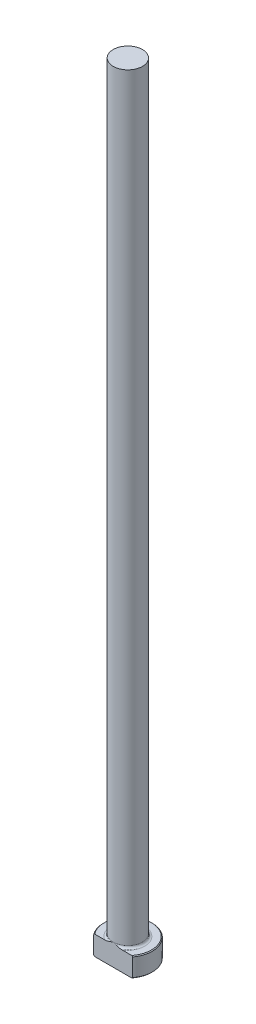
ISO-10303-21;
HEADER;
FILE_DESCRIPTION(('STEP AP214'),'2;1');
FILE_NAME('part.step','',(''),(''),'','','');
FILE_SCHEMA(('AUTOMOTIVE_DESIGN { 1 0 10303 214 1 1 1 1 }'));
ENDSEC;
DATA;
#1=APPLICATION_CONTEXT('core data for automotive mechanical design processes');
#2=APPLICATION_PROTOCOL_DEFINITION('international standard','automotive_design',2000,#1);
#3=PRODUCT_CONTEXT('',#1,'mechanical');
#4=PRODUCT('Part','Part','',(#3));
#5=PRODUCT_RELATED_PRODUCT_CATEGORY('part','',(#4));
#6=PRODUCT_DEFINITION_FORMATION('','',#4);
#7=PRODUCT_DEFINITION_CONTEXT('part definition',#1,'design');
#8=PRODUCT_DEFINITION('design','',#6,#7);
#9=PRODUCT_DEFINITION_SHAPE('','',#8);
#10=(LENGTH_UNIT() NAMED_UNIT(*) SI_UNIT(.MILLI.,.METRE.));
#11=(NAMED_UNIT(*) PLANE_ANGLE_UNIT() SI_UNIT($,.RADIAN.));
#12=(NAMED_UNIT(*) SI_UNIT($,.STERADIAN.) SOLID_ANGLE_UNIT());
#13=UNCERTAINTY_MEASURE_WITH_UNIT(LENGTH_MEASURE(1.E-05),#10,'distance_accuracy_value','');
#14=(GEOMETRIC_REPRESENTATION_CONTEXT(3) GLOBAL_UNCERTAINTY_ASSIGNED_CONTEXT((#13)) GLOBAL_UNIT_ASSIGNED_CONTEXT((#10,
#11,#12)) REPRESENTATION_CONTEXT('',''));
#15=CARTESIAN_POINT('',(0.,0.,0.));
#16=DIRECTION('',(0.,0.,1.));
#17=DIRECTION('',(1.,0.,0.));
#18=AXIS2_PLACEMENT_3D('',#15,#16,#17);
#19=CARTESIAN_POINT('',(0.,0.,0.));
#20=DIRECTION('',(0.,-1.,0.));
#21=DIRECTION('',(0.,0.,-1.));
#22=AXIS2_PLACEMENT_3D('',#19,#20,#21);
#23=PLANE('',#22);
#24=CARTESIAN_POINT('',(0.,0.,0.));
#25=DIRECTION('',(0.,-1.,0.));
#26=DIRECTION('',(0.,0.,-1.));
#27=AXIS2_PLACEMENT_3D('',#24,#25,#26);
#28=CIRCLE('',#27,7.68349999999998);
#29=CARTESIAN_POINT('',(-6.02949135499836,0.,4.76249999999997));
#30=VERTEX_POINT('',#29);
#31=CARTESIAN_POINT('',(6.02949135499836,0.,4.76249999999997));
#32=VERTEX_POINT('',#31);
#33=EDGE_CURVE('E98',#30,#32,#28,.T.);
#34=ORIENTED_EDGE('',*,*,#33,.T.);
#35=DIRECTION('',(-1.,0.,0.));
#36=VECTOR('',#35,1.);
#37=CARTESIAN_POINT('',(-6.34999999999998,0.,4.76249999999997));
#38=LINE('',#37,#36);
#39=EDGE_CURVE('E83',#32,#30,#38,.T.);
#40=ORIENTED_EDGE('',*,*,#39,.T.);
#41=EDGE_LOOP('',(#34,#40));
#42=FACE_BOUND('',#41,.T.);
#43=ADVANCED_FACE('F32',(#42),#23,.T.);
#44=CARTESIAN_POINT('',(0.,259.958771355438,0.));
#45=DIRECTION('',(0.,1.,0.));
#46=DIRECTION('',(0.,0.,1.));
#47=AXIS2_PLACEMENT_3D('',#44,#45,#46);
#48=CYLINDRICAL_SURFACE('',#47,7.93749999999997);
#49=CARTESIAN_POINT('',(0.,6.09599999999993,0.));
#50=DIRECTION('',(0.,1.,0.));
#51=DIRECTION('',(0.,0.,1.));
#52=AXIS2_PLACEMENT_3D('',#49,#50,#51);
#53=CIRCLE('',#52,7.93749999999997);
#54=CARTESIAN_POINT('',(-6.34999999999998,6.09599999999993,4.76249999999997));
#55=VERTEX_POINT('',#54);
#56=CARTESIAN_POINT('',(6.34999999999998,6.09599999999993,4.76249999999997));
#57=VERTEX_POINT('',#56);
#58=EDGE_CURVE('E104',#55,#57,#53,.F.);
#59=ORIENTED_EDGE('',*,*,#58,.T.);
#60=DIRECTION('',(0.,-1.,0.));
#61=VECTOR('',#60,1.);
#62=CARTESIAN_POINT('',(6.34999999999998,254.,4.76249999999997));
#63=LINE('',#62,#61);
#64=CARTESIAN_POINT('',(6.34999999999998,0.253999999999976,4.76249999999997));
#65=VERTEX_POINT('',#64);
#66=EDGE_CURVE('E183',#57,#65,#63,.T.);
#67=ORIENTED_EDGE('',*,*,#66,.T.);
#68=CARTESIAN_POINT('',(0.,0.253999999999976,0.));
#69=DIRECTION('',(0.,-1.,0.));
#70=DIRECTION('',(0.,0.,-1.));
#71=AXIS2_PLACEMENT_3D('',#68,#69,#70);
#72=CIRCLE('',#71,7.93749999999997);
#73=CARTESIAN_POINT('',(-6.34999999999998,0.253999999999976,4.76249999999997));
#74=VERTEX_POINT('',#73);
#75=EDGE_CURVE('E100',#65,#74,#72,.F.);
#76=ORIENTED_EDGE('',*,*,#75,.T.);
#77=DIRECTION('',(0.,-1.,0.));
#78=VECTOR('',#77,1.);
#79=CARTESIAN_POINT('',(-6.34999999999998,254.,4.76249999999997));
#80=LINE('',#79,#78);
#81=EDGE_CURVE('E93',#55,#74,#80,.T.);
#82=ORIENTED_EDGE('',*,*,#81,.F.);
#83=EDGE_LOOP('',(#59,#67,#76,#82));
#84=FACE_BOUND('',#83,.T.);
#85=ADVANCED_FACE('F158',(#84),#48,.T.);
#86=CARTESIAN_POINT('',(-7.93749999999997,6.35,0.));
#87=DIRECTION('',(0.,1.,0.));
#88=DIRECTION('',(0.,0.,1.));
#89=AXIS2_PLACEMENT_3D('',#86,#87,#88);
#90=PLANE('',#89);
#91=CARTESIAN_POINT('',(0.,6.35,0.));
#92=DIRECTION('',(0.,1.,0.));
#93=DIRECTION('',(0.,0.,1.));
#94=AXIS2_PLACEMENT_3D('',#91,#92,#93);
#95=CIRCLE('',#94,7.68349999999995);
#96=CARTESIAN_POINT('',(6.02949135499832,6.35,4.76249999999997));
#97=VERTEX_POINT('',#96);
#98=CARTESIAN_POINT('',(-6.02949135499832,6.35,4.76249999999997));
#99=VERTEX_POINT('',#98);
#100=EDGE_CURVE('E178',#97,#99,#95,.T.);
#101=ORIENTED_EDGE('',*,*,#100,.T.);
#102=DIRECTION('',(1.,0.,0.));
#103=VECTOR('',#102,1.);
#104=CARTESIAN_POINT('',(-7.93749999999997,6.35,4.76249999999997));
#105=LINE('',#104,#103);
#106=CARTESIAN_POINT('',(-2.79976677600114,6.35000000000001,4.76249999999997));
#107=VERTEX_POINT('',#106);
#108=EDGE_CURVE('E57',#99,#107,#105,.T.);
#109=ORIENTED_EDGE('',*,*,#108,.T.);
#110=CARTESIAN_POINT('',(0.,6.35,0.));
#111=DIRECTION('',(0.,1.,0.));
#112=DIRECTION('',(0.,0.,1.));
#113=AXIS2_PLACEMENT_3D('',#110,#111,#112);
#114=CIRCLE('',#113,5.52449999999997);
#115=CARTESIAN_POINT('',(2.79976677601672,6.35000000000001,4.76249999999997));
#116=VERTEX_POINT('',#115);
#117=EDGE_CURVE('E107',#107,#116,#114,.F.);
#118=ORIENTED_EDGE('',*,*,#117,.T.);
#119=EDGE_CURVE('E136',#116,#97,#105,.T.);
#120=ORIENTED_EDGE('',*,*,#119,.T.);
#121=EDGE_LOOP('',(#101,#109,#118,#120));
#122=FACE_BOUND('',#121,.T.);
#123=ADVANCED_FACE('F147',(#122),#90,.T.);
#124=CARTESIAN_POINT('',(0.,6.35000000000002,0.));
#125=DIRECTION('',(0.,-1.,0.));
#126=DIRECTION('',(0.,0.,-1.));
#127=AXIS2_PLACEMENT_3D('',#124,#125,#126);
#128=CONICAL_SURFACE('',#127,7.68349999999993,0.78539816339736);
#129=ORIENTED_EDGE('',*,*,#58,.F.);
#130=CARTESIAN_POINT('',(-13.9717238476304,-0.727613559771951,4.76249999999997));
#131=CARTESIAN_POINT('',(-13.7440124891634,-0.512084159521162,4.76249999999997));
#132=CARTESIAN_POINT('',(-13.5160318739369,-0.296838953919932,4.76249999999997));
#133=CARTESIAN_POINT('',(-13.0594385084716,0.132982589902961,4.76249999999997));
#134=CARTESIAN_POINT('',(-12.8308257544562,0.347558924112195,4.76249999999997));
#135=CARTESIAN_POINT('',(-12.1433698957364,0.990628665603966,4.76249999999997));
#136=CARTESIAN_POINT('',(-11.6834388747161,1.41796058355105,4.76249999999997));
#137=CARTESIAN_POINT('',(-10.7398192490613,2.28660831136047,4.76249999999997));
#138=CARTESIAN_POINT('',(-10.2559580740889,2.72773732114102,4.76249999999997));
#139=CARTESIAN_POINT('',(-9.52579613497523,3.38404130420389,4.76249999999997));
#140=CARTESIAN_POINT('',(-9.28181372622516,3.60179461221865,4.76249999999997));
#141=CARTESIAN_POINT('',(-8.79195583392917,4.03515959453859,4.76249999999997));
#142=CARTESIAN_POINT('',(-8.54608036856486,4.25077128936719,4.76249999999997));
#143=CARTESIAN_POINT('',(-8.05235063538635,4.67899963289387,4.76249999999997));
#144=CARTESIAN_POINT('',(-7.80449972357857,4.89162014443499,4.76249999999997));
#145=CARTESIAN_POINT('',(-7.30587283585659,5.31343752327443,4.76249999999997));
#146=CARTESIAN_POINT('',(-7.0550967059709,5.52263420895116,4.76249999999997));
#147=CARTESIAN_POINT('',(-6.54895570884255,5.93726289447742,4.76249999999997));
#148=CARTESIAN_POINT('',(-6.29357776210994,6.14267898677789,4.76249999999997));
#149=CARTESIAN_POINT('',(-5.77806261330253,6.54738613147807,4.76249999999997));
#150=CARTESIAN_POINT('',(-5.51792616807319,6.74667814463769,4.76249999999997));
#151=CARTESIAN_POINT('',(-4.99669315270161,7.13290361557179,4.76249999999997));
#152=CARTESIAN_POINT('',(-4.73572280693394,7.32000565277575,4.76249999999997));
#153=CARTESIAN_POINT('',(-4.33820944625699,7.59205599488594,4.76249999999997));
#154=CARTESIAN_POINT('',(-4.20463607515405,7.68134253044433,4.76249999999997));
#155=CARTESIAN_POINT('',(-3.93520014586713,7.85638938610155,4.76249999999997));
#156=CARTESIAN_POINT('',(-3.79933771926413,7.94214990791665,4.76249999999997));
#157=CARTESIAN_POINT('',(-3.5258207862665,8.10887856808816,4.76249999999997));
#158=CARTESIAN_POINT('',(-3.38818211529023,8.1898725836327,4.76249999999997));
#159=CARTESIAN_POINT('',(-3.10994368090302,8.3466779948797,4.76249999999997));
#160=CARTESIAN_POINT('',(-2.96934354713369,8.42248873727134,4.76249999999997));
#161=CARTESIAN_POINT('',(-2.68509318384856,8.56758570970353,4.76249999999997));
#162=CARTESIAN_POINT('',(-2.54144841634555,8.63688258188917,4.76249999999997));
#163=CARTESIAN_POINT('',(-2.25062082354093,8.7675871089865,4.76249999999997));
#164=CARTESIAN_POINT('',(-2.103439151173,8.82899729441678,4.76249999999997));
#165=CARTESIAN_POINT('',(-1.88433335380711,8.91218004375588,4.76249999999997));
#166=CARTESIAN_POINT('',(-1.81383186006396,8.93772120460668,4.76249999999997));
#167=CARTESIAN_POINT('',(-1.67202052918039,8.98645907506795,4.76249999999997));
#168=CARTESIAN_POINT('',(-1.60071065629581,9.00965568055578,4.76249999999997));
#169=CARTESIAN_POINT('',(-1.38555472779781,9.07542289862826,4.76249999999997));
#170=CARTESIAN_POINT('',(-1.24050522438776,9.11416209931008,4.76249999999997));
#171=CARTESIAN_POINT('',(-0.948515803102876,9.17953563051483,4.76249999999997));
#172=CARTESIAN_POINT('',(-0.801590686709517,9.20623542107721,4.76249999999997));
#173=CARTESIAN_POINT('',(-0.505930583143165,9.24644001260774,4.76249999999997));
#174=CARTESIAN_POINT('',(-0.357195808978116,9.25994635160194,4.76249999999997));
#175=CARTESIAN_POINT('',(-0.0580773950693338,9.27300540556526,4.76249999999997));
#176=CARTESIAN_POINT('',(0.0923105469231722,9.27246142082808,4.76249999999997));
#177=CARTESIAN_POINT('',(0.392354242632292,9.25721584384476,4.76249999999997));
#178=CARTESIAN_POINT('',(0.542009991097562,9.24251415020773,4.76249999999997));
#179=CARTESIAN_POINT('',(0.840076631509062,9.19973713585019,4.76249999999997));
#180=CARTESIAN_POINT('',(0.988478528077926,9.17160009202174,4.76249999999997));
#181=CARTESIAN_POINT('',(1.28250292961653,9.10341431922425,4.76249999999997));
#182=CARTESIAN_POINT('',(1.42812484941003,9.06336311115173,4.76249999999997));
#183=CARTESIAN_POINT('',(1.80157652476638,8.94630142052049,4.76249999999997));
#184=CARTESIAN_POINT('',(2.02694427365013,8.86145845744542,4.76249999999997));
#185=CARTESIAN_POINT('',(2.46947102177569,8.67257542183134,4.76249999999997));
#186=CARTESIAN_POINT('',(2.68662307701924,8.56851952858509,4.76249999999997));
#187=CARTESIAN_POINT('',(3.00782565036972,8.40144847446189,4.76249999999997));
#188=CARTESIAN_POINT('',(3.1146332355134,8.34362692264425,4.76249999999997));
#189=CARTESIAN_POINT('',(3.32653927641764,8.22492412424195,4.76249999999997));
#190=CARTESIAN_POINT('',(3.43163771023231,8.16404283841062,4.76249999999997));
#191=CARTESIAN_POINT('',(3.64022442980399,8.0397004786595,4.76249999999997));
#192=CARTESIAN_POINT('',(3.74371344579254,7.9762406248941,4.76249999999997));
#193=CARTESIAN_POINT('',(3.94927417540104,7.84708004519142,4.76249999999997));
#194=CARTESIAN_POINT('',(4.05134594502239,7.78137940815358,4.76249999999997));
#195=CARTESIAN_POINT('',(4.39010681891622,7.55875403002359,4.76249999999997));
#196=CARTESIAN_POINT('',(4.62396840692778,7.39752115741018,4.76249999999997));
#197=CARTESIAN_POINT('',(5.08629215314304,7.06746483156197,4.76249999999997));
#198=CARTESIAN_POINT('',(5.31475310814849,6.89863971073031,4.76249999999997));
#199=CARTESIAN_POINT('',(5.76756292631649,6.55523763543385,4.76249999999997));
#200=CARTESIAN_POINT('',(5.99190862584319,6.38065652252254,4.76249999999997));
#201=CARTESIAN_POINT('',(6.4371751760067,6.02723273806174,4.76249999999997));
#202=CARTESIAN_POINT('',(6.65809630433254,5.84839041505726,4.76249999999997));
#203=CARTESIAN_POINT('',(7.09790647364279,5.48680641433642,4.76249999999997));
#204=CARTESIAN_POINT('',(7.31678672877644,5.30405407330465,4.76249999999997));
#205=CARTESIAN_POINT('',(7.75231370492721,4.93590430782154,4.76249999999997));
#206=CARTESIAN_POINT('',(7.96896038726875,4.75050683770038,4.76249999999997));
#207=CARTESIAN_POINT('',(8.40032527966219,4.3776669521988,4.76249999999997));
#208=CARTESIAN_POINT('',(8.61504426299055,4.19022543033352,4.76249999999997));
#209=CARTESIAN_POINT('',(9.04295707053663,3.81360841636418,4.76249999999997));
#210=CARTESIAN_POINT('',(9.25615088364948,3.62443291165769,4.76249999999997));
#211=CARTESIAN_POINT('',(9.85099823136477,3.09302727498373,4.76249999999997));
#212=CARTESIAN_POINT('',(10.231229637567,2.74920552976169,4.76249999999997));
#213=CARTESIAN_POINT('',(10.9886755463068,2.0581727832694,4.76249999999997));
#214=CARTESIAN_POINT('',(11.3658896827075,1.71096138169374,4.76249999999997));
#215=CARTESIAN_POINT('',(12.1155837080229,1.01624347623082,4.76249999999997));
#216=CARTESIAN_POINT('',(12.4880784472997,0.668752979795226,4.76249999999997));
#217=CARTESIAN_POINT('',(13.2311819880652,-0.0281268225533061,4.76249999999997));
#218=CARTESIAN_POINT('',(13.601791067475,-0.377515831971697,4.76249999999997));
#219=CARTESIAN_POINT('',(13.9717238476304,-0.727613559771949,4.76249999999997));
#220=B_SPLINE_CURVE_WITH_KNOTS('',3,(#130,#131,#132,#133,#134,#135,#136,#137,#138,#139,#140,
#141,#142,#143,#144,#145,#146,#147,#148,#149,#150,#151,#152,#153,#154,#155,#156,#157,#158,#159,
#160,#161,#162,#163,#164,#165,#166,#167,#168,#169,#170,#171,#172,#173,#174,#175,#176,#177,#178,
#179,#180,#181,#182,#183,#184,#185,#186,#187,#188,#189,#190,#191,#192,#193,#194,#195,#196,#197,
#198,#199,#200,#201,#202,#203,#204,#205,#206,#207,#208,#209,#210,#211,#212,#213,#214,#215,#216,
#217,#218,#219),.UNSPECIFIED.,.F.,.F.,(4,2,2,2,2,2,2,2,2,2,2,2,2,2,2,2,2,2,2,2,2,2,2,2,2,2,2,2,
2,2,2,2,2,2,2,2,2,2,2,2,2,2,2,2,4),(0.,0.940610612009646,1.88122685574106,3.76464908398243,
5.7288903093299,6.70994924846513,7.69099877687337,8.67063680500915,9.65032663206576,
10.6334769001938,11.6164721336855,12.5795523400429,13.0615108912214,13.5434418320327,
14.0224542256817,14.5015268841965,14.979802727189,15.4579247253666,15.6828447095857,
15.9077746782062,16.357707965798,16.8051644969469,17.2525688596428,17.7030532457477,
18.1535408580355,18.6061182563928,19.0587898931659,19.779913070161,20.5016327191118,
20.8659558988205,21.2302837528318,21.5944411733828,21.9585841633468,22.8105074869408,
23.6626188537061,24.5153599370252,25.3680315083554,26.2234368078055,27.0788568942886,
27.9339169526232,28.7889832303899,30.3268416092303,31.8648838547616,33.3931161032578,
34.9211161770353),.UNSPECIFIED.);
#221=EDGE_CURVE('E135',#55,#99,#220,.T.);
#222=ORIENTED_EDGE('',*,*,#221,.T.);
#223=ORIENTED_EDGE('',*,*,#100,.F.);
#224=EDGE_CURVE('E127',#97,#57,#220,.T.);
#225=ORIENTED_EDGE('',*,*,#224,.T.);
#226=EDGE_LOOP('',(#129,#222,#223,#225));
#227=FACE_BOUND('',#226,.T.);
#228=ADVANCED_FACE('F143',(#227),#128,.T.);
#229=CARTESIAN_POINT('',(0.,0.253999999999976,0.));
#230=DIRECTION('',(0.,1.,0.));
#231=DIRECTION('',(0.,0.,1.));
#232=AXIS2_PLACEMENT_3D('',#229,#230,#231);
#233=CONICAL_SURFACE('',#232,7.93749999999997,0.785398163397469);
#234=ORIENTED_EDGE('',*,*,#75,.F.);
#235=CARTESIAN_POINT('',(13.9717238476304,7.07761355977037,4.76249999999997));
#236=CARTESIAN_POINT('',(13.7440124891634,6.86208415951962,4.76249999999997));
#237=CARTESIAN_POINT('',(13.5160318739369,6.64683895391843,4.76249999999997));
#238=CARTESIAN_POINT('',(13.0594385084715,6.21701741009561,4.76249999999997));
#239=CARTESIAN_POINT('',(12.8308257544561,6.00244107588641,4.76249999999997));
#240=CARTESIAN_POINT('',(12.1433698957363,5.35937133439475,4.76249999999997));
#241=CARTESIAN_POINT('',(11.683438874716,4.93203941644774,4.76249999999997));
#242=CARTESIAN_POINT('',(10.7398192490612,4.06339168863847,4.76249999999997));
#243=CARTESIAN_POINT('',(10.2559580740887,3.62226267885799,4.76249999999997));
#244=CARTESIAN_POINT('',(9.525796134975,2.96595869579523,4.76249999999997));
#245=CARTESIAN_POINT('',(9.28181372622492,2.74820538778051,4.76249999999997));
#246=CARTESIAN_POINT('',(8.79195583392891,2.31484040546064,4.76249999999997));
#247=CARTESIAN_POINT('',(8.54608036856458,2.09922871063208,4.76249999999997));
#248=CARTESIAN_POINT('',(8.05235063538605,1.67100036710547,4.76249999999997));
#249=CARTESIAN_POINT('',(7.80449972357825,1.45837985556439,4.76249999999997));
#250=CARTESIAN_POINT('',(7.30587283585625,1.03656247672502,4.76249999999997));
#251=CARTESIAN_POINT('',(7.05509670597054,0.827365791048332,4.76249999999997));
#252=CARTESIAN_POINT('',(6.54895570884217,0.412737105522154,4.76249999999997));
#253=CARTESIAN_POINT('',(6.29357776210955,0.207321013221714,4.76249999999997));
#254=CARTESIAN_POINT('',(5.77806261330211,-0.197386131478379,4.76249999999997));
#255=CARTESIAN_POINT('',(5.51792616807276,-0.396678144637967,4.76249999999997));
#256=CARTESIAN_POINT('',(4.99669315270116,-0.782903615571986,4.76249999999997));
#257=CARTESIAN_POINT('',(4.73572280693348,-0.970005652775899,4.76249999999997));
#258=CARTESIAN_POINT('',(4.33820944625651,-1.24205599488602,4.76249999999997));
#259=CARTESIAN_POINT('',(4.20463607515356,-1.33134253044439,4.76249999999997));
#260=CARTESIAN_POINT('',(3.93520014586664,-1.50638938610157,4.76249999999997));
#261=CARTESIAN_POINT('',(3.79933771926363,-1.59214990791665,4.76249999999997));
#262=CARTESIAN_POINT('',(3.525820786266,-1.75887856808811,4.76249999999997));
#263=CARTESIAN_POINT('',(3.38818211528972,-1.83987258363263,4.76249999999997));
#264=CARTESIAN_POINT('',(3.1099436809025,-1.99667799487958,4.76249999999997));
#265=CARTESIAN_POINT('',(2.96934354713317,-2.07248873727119,4.76249999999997));
#266=CARTESIAN_POINT('',(2.68509318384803,-2.21758570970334,4.76249999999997));
#267=CARTESIAN_POINT('',(2.54144841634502,-2.28688258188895,4.76249999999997));
#268=CARTESIAN_POINT('',(2.25062082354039,-2.41758710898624,4.76249999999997));
#269=CARTESIAN_POINT('',(2.10343915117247,-2.47899729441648,4.76249999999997));
#270=CARTESIAN_POINT('',(1.88433335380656,-2.56218004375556,4.76249999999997));
#271=CARTESIAN_POINT('',(1.81383186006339,-2.58772120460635,4.76249999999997));
#272=CARTESIAN_POINT('',(1.6720205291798,-2.63645907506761,4.76249999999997));
#273=CARTESIAN_POINT('',(1.60071065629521,-2.65965568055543,4.76249999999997));
#274=CARTESIAN_POINT('',(1.38555472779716,-2.72542289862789,4.76249999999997));
#275=CARTESIAN_POINT('',(1.24050522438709,-2.76416209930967,4.76249999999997));
#276=CARTESIAN_POINT('',(0.94851580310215,-2.82953563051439,4.76249999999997));
#277=CARTESIAN_POINT('',(0.801590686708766,-2.85623542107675,4.76249999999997));
#278=CARTESIAN_POINT('',(0.505930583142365,-2.89644001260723,4.76249999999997));
#279=CARTESIAN_POINT('',(0.357195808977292,-2.9099463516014,4.76249999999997));
#280=CARTESIAN_POINT('',(0.0580773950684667,-2.92300540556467,4.76249999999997));
#281=CARTESIAN_POINT('',(-0.0923105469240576,-2.92246142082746,4.76249999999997));
#282=CARTESIAN_POINT('',(-0.392354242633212,-2.90721584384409,4.76249999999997));
#283=CARTESIAN_POINT('',(-0.5420099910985,-2.89251415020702,4.76249999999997));
#284=CARTESIAN_POINT('',(-0.840076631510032,-2.84973713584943,4.76249999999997));
#285=CARTESIAN_POINT('',(-0.988478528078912,-2.82160009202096,4.76249999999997));
#286=CARTESIAN_POINT('',(-1.28250292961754,-2.75341431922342,4.76249999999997));
#287=CARTESIAN_POINT('',(-1.42812484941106,-2.71336311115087,4.76249999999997));
#288=CARTESIAN_POINT('',(-1.80157652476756,-2.59630142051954,4.76249999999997));
#289=CARTESIAN_POINT('',(-2.02694427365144,-2.5114584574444,4.76249999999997));
#290=CARTESIAN_POINT('',(-2.46947102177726,-2.32257542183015,4.76249999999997));
#291=CARTESIAN_POINT('',(-2.68662307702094,-2.21851952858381,4.76249999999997));
#292=CARTESIAN_POINT('',(-3.0078256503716,-2.05144847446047,4.76249999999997));
#293=CARTESIAN_POINT('',(-3.11463323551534,-1.99362692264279,4.76249999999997));
#294=CARTESIAN_POINT('',(-3.3265392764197,-1.87492412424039,4.76249999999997));
#295=CARTESIAN_POINT('',(-3.43163771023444,-1.81404283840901,4.76249999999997));
#296=CARTESIAN_POINT('',(-3.64022442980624,-1.68970047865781,4.76249999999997));
#297=CARTESIAN_POINT('',(-3.74371344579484,-1.62624062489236,4.76249999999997));
#298=CARTESIAN_POINT('',(-3.94927417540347,-1.49708004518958,4.76249999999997));
#299=CARTESIAN_POINT('',(-4.05134594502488,-1.43137940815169,4.76249999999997));
#300=CARTESIAN_POINT('',(-4.39010681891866,-1.2087540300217,4.76249999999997));
#301=CARTESIAN_POINT('',(-4.62396840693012,-1.04752115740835,4.76249999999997));
#302=CARTESIAN_POINT('',(-5.08629215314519,-0.71746483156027,4.76249999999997));
#303=CARTESIAN_POINT('',(-5.31475310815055,-0.548639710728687,4.76249999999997));
#304=CARTESIAN_POINT('',(-5.76756292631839,-0.205237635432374,4.76249999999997));
#305=CARTESIAN_POINT('',(-5.991908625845,-0.03065652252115,4.76249999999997));
#306=CARTESIAN_POINT('',(-6.43717517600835,0.322767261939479,4.76249999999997));
#307=CARTESIAN_POINT('',(-6.65809630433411,0.50160958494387,4.76249999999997));
#308=CARTESIAN_POINT('',(-7.0979064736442,0.863193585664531,4.76249999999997));
#309=CARTESIAN_POINT('',(-7.31678672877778,1.04594592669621,4.76249999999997));
#310=CARTESIAN_POINT('',(-7.7523137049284,1.41409569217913,4.76249999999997));
#311=CARTESIAN_POINT('',(-7.96896038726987,1.5994931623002,4.76249999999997));
#312=CARTESIAN_POINT('',(-8.40032527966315,1.97233304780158,4.76249999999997));
#313=CARTESIAN_POINT('',(-8.61504426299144,2.15977456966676,4.76249999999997));
#314=CARTESIAN_POINT('',(-9.04295707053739,2.5363915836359,4.76249999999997));
#315=CARTESIAN_POINT('',(-9.25615088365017,2.72556708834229,4.76249999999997));
#316=CARTESIAN_POINT('',(-9.85099823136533,3.25697272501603,4.76249999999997));
#317=CARTESIAN_POINT('',(-10.2312296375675,3.60079447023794,4.76249999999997));
#318=CARTESIAN_POINT('',(-10.9886755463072,4.29182721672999,4.76249999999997));
#319=CARTESIAN_POINT('',(-11.3658896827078,4.63903861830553,4.76249999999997));
#320=CARTESIAN_POINT('',(-12.1155837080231,5.3337565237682,4.76249999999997));
#321=CARTESIAN_POINT('',(-12.4880784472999,5.68124702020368,4.76249999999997));
#322=CARTESIAN_POINT('',(-13.2311819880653,6.37812682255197,4.76249999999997));
#323=CARTESIAN_POINT('',(-13.6017910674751,6.72751583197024,4.76249999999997));
#324=CARTESIAN_POINT('',(-13.9717238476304,7.07761355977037,4.76249999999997));
#325=B_SPLINE_CURVE_WITH_KNOTS('',3,(#235,#236,#237,#238,#239,#240,#241,#242,#243,#244,#245,
#246,#247,#248,#249,#250,#251,#252,#253,#254,#255,#256,#257,#258,#259,#260,#261,#262,#263,#264,
#265,#266,#267,#268,#269,#270,#271,#272,#273,#274,#275,#276,#277,#278,#279,#280,#281,#282,#283,
#284,#285,#286,#287,#288,#289,#290,#291,#292,#293,#294,#295,#296,#297,#298,#299,#300,#301,#302,
#303,#304,#305,#306,#307,#308,#309,#310,#311,#312,#313,#314,#315,#316,#317,#318,#319,#320,#321,
#322,#323,#324),.UNSPECIFIED.,.F.,.F.,(4,2,2,2,2,2,2,2,2,2,2,2,2,2,2,2,2,2,2,2,2,2,2,2,2,2,2,2,
2,2,2,2,2,2,2,2,2,2,2,2,2,2,2,2,4),(0.,0.940610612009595,1.88122685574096,3.76464908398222,
5.7288903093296,6.70994924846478,7.69099877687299,8.67063680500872,9.65032663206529,
10.6334769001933,11.6164721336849,12.5795523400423,13.0615108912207,13.543441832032,
14.022454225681,14.5015268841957,14.9798027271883,15.4579247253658,15.682844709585,
15.9077746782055,16.3577079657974,16.8051644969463,17.2525688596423,17.7030532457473,
18.1535408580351,18.6061182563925,19.0587898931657,19.7799130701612,20.5016327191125,
20.8659558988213,21.2302837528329,21.5944411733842,21.9585841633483,22.8105074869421,
23.6626188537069,24.5153599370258,25.3680315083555,26.2234368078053,27.0788568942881,
27.9339169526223,28.7889832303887,30.3268416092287,31.8648838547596,33.3931161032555,
34.9211161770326),.UNSPECIFIED.);
#326=EDGE_CURVE('E86',#65,#32,#325,.T.);
#327=ORIENTED_EDGE('',*,*,#326,.T.);
#328=ORIENTED_EDGE('',*,*,#33,.F.);
#329=EDGE_CURVE('E89',#30,#74,#325,.T.);
#330=ORIENTED_EDGE('',*,*,#329,.T.);
#331=EDGE_LOOP('',(#234,#327,#328,#330));
#332=FACE_BOUND('',#331,.T.);
#333=ADVANCED_FACE('F97',(#332),#233,.T.);
#334=CARTESIAN_POINT('',(0.,7.11200000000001,0.));
#335=DIRECTION('',(0.,1.,0.));
#336=DIRECTION('',(0.,0.,1.));
#337=AXIS2_PLACEMENT_3D('',#334,#335,#336);
#338=TOROIDAL_SURFACE('',#337,5.52449999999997,0.762);
#339=CARTESIAN_POINT('',(0.,7.11200000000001,4.76249999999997));
#340=CARTESIAN_POINT('',(1.7571576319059E-10,7.11200099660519,4.76249999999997));
#341=CARTESIAN_POINT('',(2.11716127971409E-07,7.11200199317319,4.76249999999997));
#342=CARTESIAN_POINT('',(8.80753956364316E-07,7.1120039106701,4.76249999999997));
#343=CARTESIAN_POINT('',(1.34491796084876E-06,7.11200482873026,4.76249999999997));
#344=CARTESIAN_POINT('',(2.45982947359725E-06,7.11200666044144,4.76249999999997));
#345=CARTESIAN_POINT('',(3.12384157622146E-06,7.11200756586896,4.76249999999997));
#346=CARTESIAN_POINT('',(4.5550794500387E-06,7.11200927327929,4.76249999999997));
#347=CARTESIAN_POINT('',(5.32136303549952E-06,7.11201007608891,4.76249999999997));
#348=CARTESIAN_POINT('',(8.07192927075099E-06,7.11201277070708,4.76249999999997));
#349=CARTESIAN_POINT('',(1.01901643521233E-05,7.11201452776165,4.76249999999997));
#350=CARTESIAN_POINT('',(1.4565159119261E-05,7.11201765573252,4.76249999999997));
#351=CARTESIAN_POINT('',(1.68139275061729E-05,7.11201903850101,4.76249999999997));
#352=CARTESIAN_POINT('',(2.56002968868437E-05,7.1120242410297,4.76249999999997));
#353=CARTESIAN_POINT('',(3.23057719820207E-05,7.11202779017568,4.76249999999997));
#354=CARTESIAN_POINT('',(4.55210144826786E-05,7.11203358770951,4.76249999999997));
#355=CARTESIAN_POINT('',(5.19929180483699E-05,7.1120359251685,4.76249999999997));
#356=CARTESIAN_POINT('',(7.95921607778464E-05,7.11204586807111,4.76249999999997));
#357=CARTESIAN_POINT('',(0.000100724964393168,7.11205341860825,4.76249999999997));
#358=CARTESIAN_POINT('',(0.00014026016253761,7.11206552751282,4.76249999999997));
#359=CARTESIAN_POINT('',(0.000158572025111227,7.11207036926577,4.76249999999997));
#360=CARTESIAN_POINT('',(0.000291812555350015,7.11210874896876,4.76249999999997));
#361=CARTESIAN_POINT('',(0.000401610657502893,7.11215771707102,4.76249999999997));
#362=CARTESIAN_POINT('',(0.0008287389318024,7.1123412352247,4.76249999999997));
#363=CARTESIAN_POINT('',(0.00114963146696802,7.11246431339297,4.76249999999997));
#364=CARTESIAN_POINT('',(0.00239628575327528,7.11294956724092,4.76249999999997));
#365=CARTESIAN_POINT('',(0.00331839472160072,7.11332376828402,4.76249999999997));
#366=CARTESIAN_POINT('',(0.00709602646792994,7.11484953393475,4.76249999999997));
#367=CARTESIAN_POINT('',(0.00995556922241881,7.11598757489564,4.76249999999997));
#368=CARTESIAN_POINT('',(0.0776380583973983,7.14293320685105,4.76249999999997));
#369=CARTESIAN_POINT('',(0.142407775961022,7.16892226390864,4.76249999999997));
#370=CARTESIAN_POINT('',(0.269647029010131,7.2196189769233,4.76249999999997));
#371=CARTESIAN_POINT('',(0.332112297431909,7.24433828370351,4.76249999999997));
#372=CARTESIAN_POINT('',(0.464537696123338,7.29630170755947,4.76249999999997));
#373=CARTESIAN_POINT('',(0.534515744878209,7.32350106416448,4.76249999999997));
#374=CARTESIAN_POINT('',(0.67548014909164,7.3774238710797,4.76249999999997));
#375=CARTESIAN_POINT('',(0.746469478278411,7.40413956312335,4.76249999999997));
#376=CARTESIAN_POINT('',(0.870073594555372,7.44962494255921,4.76249999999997));
#377=CARTESIAN_POINT('',(0.922600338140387,7.46863321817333,4.76249999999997));
#378=CARTESIAN_POINT('',(1.02776923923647,7.50591527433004,4.76249999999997));
#379=CARTESIAN_POINT('',(1.08041080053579,7.52419073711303,4.76249999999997));
#380=CARTESIAN_POINT('',(1.23635883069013,7.5769919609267,4.76249999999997));
#381=CARTESIAN_POINT('',(1.34005657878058,7.61037532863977,4.76249999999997));
#382=CARTESIAN_POINT('',(1.56359060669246,7.67746997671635,4.76249999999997));
#383=CARTESIAN_POINT('',(1.68362015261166,7.71054957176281,4.76249999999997));
#384=CARTESIAN_POINT('',(1.92642555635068,7.76967498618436,4.76249999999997));
#385=CARTESIAN_POINT('',(2.04921557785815,7.79566353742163,4.76249999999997));
#386=CARTESIAN_POINT('',(2.30422797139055,7.83918726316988,4.76249999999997));
#387=CARTESIAN_POINT('',(2.43656426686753,7.85610069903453,4.76249999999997));
#388=CARTESIAN_POINT('',(2.63563546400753,7.8702758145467,4.76249999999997));
#389=CARTESIAN_POINT('',(2.70197039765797,7.87313972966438,4.76249999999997));
#390=CARTESIAN_POINT('',(2.83467605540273,7.87452977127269,4.76249999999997));
#391=CARTESIAN_POINT('',(2.90104677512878,7.87305634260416,4.76249999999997));
#392=CARTESIAN_POINT('',(3.06624711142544,7.86305254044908,4.76249999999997));
#393=CARTESIAN_POINT('',(3.1649502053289,7.85140164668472,4.76249999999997));
#394=CARTESIAN_POINT('',(3.3102514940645,7.82310986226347,4.76249999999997));
#395=CARTESIAN_POINT('',(3.35793795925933,7.81197880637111,4.76249999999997));
#396=CARTESIAN_POINT('',(3.45215770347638,7.78564548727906,4.76249999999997));
#397=CARTESIAN_POINT('',(3.49869187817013,7.77044650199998,4.76249999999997));
#398=CARTESIAN_POINT('',(3.59306902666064,7.73421407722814,4.76249999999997));
#399=CARTESIAN_POINT('',(3.64079022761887,7.71285751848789,4.76249999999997));
#400=CARTESIAN_POINT('',(3.73313951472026,7.66398014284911,4.76249999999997));
#401=CARTESIAN_POINT('',(3.77776331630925,7.63645100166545,4.76249999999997));
#402=CARTESIAN_POINT('',(3.8538778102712,7.58041326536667,4.76249999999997));
#403=CARTESIAN_POINT('',(3.88624519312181,7.55310714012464,4.76249999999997));
#404=CARTESIAN_POINT('',(3.94622799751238,7.49369496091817,4.76249999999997));
#405=CARTESIAN_POINT('',(3.97385320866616,7.46159905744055,4.76249999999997));
#406=CARTESIAN_POINT('',(4.01655184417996,7.4011650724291,4.76249999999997));
#407=CARTESIAN_POINT('',(4.03304226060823,7.37383278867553,4.76249999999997));
#408=CARTESIAN_POINT('',(4.06135260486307,7.31682811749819,4.76249999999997));
#409=CARTESIAN_POINT('',(4.07317539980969,7.28715718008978,4.76249999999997));
#410=CARTESIAN_POINT('',(4.09136459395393,7.22592510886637,4.76249999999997));
#411=CARTESIAN_POINT('',(4.09769076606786,7.19435181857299,4.76249999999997));
#412=CARTESIAN_POINT('',(4.10417375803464,7.13057793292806,4.76249999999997));
#413=CARTESIAN_POINT('',(4.10433369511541,7.0983776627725,4.76249999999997));
#414=CARTESIAN_POINT('',(4.09881588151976,7.03816798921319,4.76249999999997));
#415=CARTESIAN_POINT('',(4.09379438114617,7.01009545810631,4.76249999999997));
#416=CARTESIAN_POINT('',(4.07925766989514,6.95514890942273,4.76249999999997));
#417=CARTESIAN_POINT('',(4.06974176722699,6.92827507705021,4.76249999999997));
#418=CARTESIAN_POINT('',(4.04639465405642,6.87537805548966,4.76249999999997));
#419=CARTESIAN_POINT('',(4.03242569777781,6.84941634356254,4.76249999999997));
#420=CARTESIAN_POINT('',(4.00102190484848,6.79970293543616,4.76249999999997));
#421=CARTESIAN_POINT('',(3.98358563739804,6.77595215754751,4.76249999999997));
#422=CARTESIAN_POINT('',(3.93494606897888,6.71761387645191,4.76249999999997));
#423=CARTESIAN_POINT('',(3.90164076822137,6.68477550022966,4.76249999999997));
#424=CARTESIAN_POINT('',(3.83023707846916,6.62476083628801,4.76249999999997));
#425=CARTESIAN_POINT('',(3.79212391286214,6.59760272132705,4.76249999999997));
#426=CARTESIAN_POINT('',(3.69123876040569,6.53519525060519,4.76249999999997));
#427=CARTESIAN_POINT('',(3.62627547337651,6.5035096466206,4.76249999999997));
#428=CARTESIAN_POINT('',(3.49255240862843,6.45041788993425,4.76249999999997));
#429=CARTESIAN_POINT('',(3.42379589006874,6.42900306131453,4.76249999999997));
#430=CARTESIAN_POINT('',(3.29415895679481,6.39697273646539,4.76249999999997));
#431=CARTESIAN_POINT('',(3.23354049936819,6.38525800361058,4.76249999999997));
#432=CARTESIAN_POINT('',(3.11149484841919,6.36705546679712,4.76249999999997));
#433=CARTESIAN_POINT('',(3.05006701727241,6.36057206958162,4.76249999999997));
#434=CARTESIAN_POINT('',(2.92589148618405,6.35201311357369,4.76249999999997));
#435=CARTESIAN_POINT('',(2.86313887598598,6.35001297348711,4.76249999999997));
#436=CARTESIAN_POINT('',(2.73768820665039,6.34998716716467,4.76249999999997));
#437=CARTESIAN_POINT('',(2.67499013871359,6.35195889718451,4.76249999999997));
#438=CARTESIAN_POINT('',(2.52932457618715,6.3605299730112,4.76249999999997));
#439=CARTESIAN_POINT('',(2.44643477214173,6.36843196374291,4.76249999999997));
#440=CARTESIAN_POINT('',(2.28127175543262,6.38922870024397,4.76249999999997));
#441=CARTESIAN_POINT('',(2.19899884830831,6.40212577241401,4.76249999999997));
#442=CARTESIAN_POINT('',(1.95269348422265,6.44712458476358,4.76249999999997));
#443=CARTESIAN_POINT('',(1.78980549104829,6.48548332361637,4.76249999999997));
#444=CARTESIAN_POINT('',(1.48033682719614,6.56994207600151,4.76249999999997));
#445=CARTESIAN_POINT('',(1.33350347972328,6.615164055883,4.76249999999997));
#446=CARTESIAN_POINT('',(1.04345459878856,6.71161170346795,4.76249999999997));
#447=CARTESIAN_POINT('',(0.900217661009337,6.76277370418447,4.76249999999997));
#448=CARTESIAN_POINT('',(0.704750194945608,6.83559047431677,4.76249999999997));
#449=CARTESIAN_POINT('',(0.651886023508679,6.85558735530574,4.76249999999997));
#450=CARTESIAN_POINT('',(0.544940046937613,6.89652727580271,4.76249999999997));
#451=CARTESIAN_POINT('',(0.49086245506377,6.91748138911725,4.76249999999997));
#452=CARTESIAN_POINT('',(0.399545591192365,6.95317215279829,4.76249999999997));
#453=CARTESIAN_POINT('',(0.362273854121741,6.96782635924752,4.76249999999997));
#454=CARTESIAN_POINT('',(0.288146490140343,6.9971046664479,4.76249999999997));
#455=CARTESIAN_POINT('',(0.251290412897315,7.01172761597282,4.76249999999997));
#456=CARTESIAN_POINT('',(0.181451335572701,7.03949988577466,4.76249999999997));
#457=CARTESIAN_POINT('',(0.14846593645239,7.05264357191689,4.76249999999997));
#458=CARTESIAN_POINT('',(0.0812672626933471,7.07951218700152,4.76249999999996));
#459=CARTESIAN_POINT('',(0.0470550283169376,7.09324020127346,4.76249999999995));
#460=CARTESIAN_POINT('',(0.00995870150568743,7.10801136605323,4.76249999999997));
#461=CARTESIAN_POINT('',(0.00710220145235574,7.10914804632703,4.76249999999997));
#462=CARTESIAN_POINT('',(0.00332530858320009,7.11067346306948,4.76249999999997));
#463=CARTESIAN_POINT('',(0.00240087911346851,7.11104861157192,4.76249999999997));
#464=CARTESIAN_POINT('',(0.0011512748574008,7.11153501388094,4.76249999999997));
#465=CARTESIAN_POINT('',(0.000829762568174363,7.11165833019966,4.76249999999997));
#466=CARTESIAN_POINT('',(0.000401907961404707,7.1118421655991,4.76249999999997));
#467=CARTESIAN_POINT('',(0.000291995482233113,7.11189118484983,4.76249999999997));
#468=CARTESIAN_POINT('',(0.000158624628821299,7.11192959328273,4.76249999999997));
#469=CARTESIAN_POINT('',(0.000140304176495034,7.11193443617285,4.76249999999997));
#470=CARTESIAN_POINT('',(0.000100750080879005,7.11194655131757,4.76249999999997));
#471=CARTESIAN_POINT('',(7.96072020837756E-05,7.11195410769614,4.76249999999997));
#472=CARTESIAN_POINT('',(5.19966524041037E-05,7.11196405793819,4.76249999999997));
#473=CARTESIAN_POINT('',(4.55234098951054E-05,7.11196639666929,4.76249999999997));
#474=CARTESIAN_POINT('',(3.23056445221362E-05,7.11197219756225,4.76249999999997));
#475=CARTESIAN_POINT('',(2.559903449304E-05,7.11197574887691,4.76249999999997));
#476=CARTESIAN_POINT('',(1.68115971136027E-05,7.11198095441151,4.76249999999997));
#477=CARTESIAN_POINT('',(1.45627239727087E-05,7.11198233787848,4.76249999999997));
#478=CARTESIAN_POINT('',(1.01876581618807E-05,7.11198546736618,4.76249999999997));
#479=CARTESIAN_POINT('',(8.06946388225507E-06,7.11198722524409,4.76249999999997));
#480=CARTESIAN_POINT('',(5.31911935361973E-06,7.1119899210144,4.76249999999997));
#481=CARTESIAN_POINT('',(4.55293266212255E-06,7.11199072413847,4.76249999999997));
#482=CARTESIAN_POINT('',(3.12194490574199E-06,7.11199243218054,4.76249999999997));
#483=CARTESIAN_POINT('',(2.45808667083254E-06,7.11199333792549,4.76249999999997));
#484=CARTESIAN_POINT('',(1.34354729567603E-06,7.11199517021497,4.76249999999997));
#485=CARTESIAN_POINT('',(8.79593877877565E-07,7.11199608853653,4.76249999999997));
#486=CARTESIAN_POINT('',(2.11067520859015E-07,7.11199800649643,4.76249999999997));
#487=CARTESIAN_POINT('',(-1.75738333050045E-10,7.11199900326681,4.76249999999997));
#488=CARTESIAN_POINT('',(0.,7.11200000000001,4.76249999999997));
#489=B_SPLINE_CURVE_WITH_KNOTS('',3,(#339,#340,#341,#342,#343,#344,#345,#346,#347,#348,#349,
#350,#351,#352,#353,#354,#355,#356,#357,#358,#359,#360,#361,#362,#363,#364,#365,#366,#367,#368,
#369,#370,#371,#372,#373,#374,#375,#376,#377,#378,#379,#380,#381,#382,#383,#384,#385,#386,#387,
#388,#389,#390,#391,#392,#393,#394,#395,#396,#397,#398,#399,#400,#401,#402,#403,#404,#405,#406,
#407,#408,#409,#410,#411,#412,#413,#414,#415,#416,#417,#418,#419,#420,#421,#422,#423,#424,#425,
#426,#427,#428,#429,#430,#431,#432,#433,#434,#435,#436,#437,#438,#439,#440,#441,#442,#443,#444,
#445,#446,#447,#448,#449,#450,#451,#452,#453,#454,#455,#456,#457,#458,#459,#460,#461,#462,#463,
#464,#465,#466,#467,#468,#469,#470,#471,#472,#473,#474,#475,#476,#477,#478,#479,#480,#481,#482,
#483,#484,#485,#486,#487,#488),.UNSPECIFIED.,.T.,.F.,(4,2,2,2,2,2,2,2,2,2,2,2,2,2,2,2,2,2,2,2,2,
2,2,2,2,2,2,2,2,2,2,2,2,2,2,2,2,2,2,2,2,2,2,2,2,2,2,2,2,2,2,2,2,2,2,2,2,2,2,2,2,2,2,2,2,2,2,2,2,
2,2,2,2,2,4),(0.,2.98829248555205E-06,6.05956342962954E-06,9.41423004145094E-06,
1.27398874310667E-05,2.09563297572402E-05,2.88697099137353E-05,5.15590448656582E-05,
7.21804381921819E-05,0.000139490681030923,0.000196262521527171,0.00055555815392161,
0.00158774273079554,0.00457176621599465,0.0138062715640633,0.223151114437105,0.424691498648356,
0.649921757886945,0.877465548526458,1.04504215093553,1.21220902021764,1.5389642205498,
1.91230059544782,2.28856838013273,2.68809156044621,2.88715755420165,3.08620313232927,
3.3833626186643,3.5301266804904,3.67677283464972,3.83326124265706,3.98996197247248,
4.1165818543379,4.24293711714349,4.33833631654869,4.43367682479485,4.52970934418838,
4.62569331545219,4.71085370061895,4.79602719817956,4.88414369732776,4.9722966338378,
5.1118129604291,5.25176903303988,5.46739168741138,5.6828318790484,5.86779164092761,
6.05290704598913,6.24111386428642,6.42919734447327,6.67879819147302,6.92851542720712,
7.42983936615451,7.89058054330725,8.3467738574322,8.51633402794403,8.69031772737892,
8.81046509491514,8.92941700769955,9.03594279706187,9.14652227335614,9.15574682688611,
9.15873836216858,9.15977254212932,9.16013221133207,9.16018900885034,9.16025635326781,
9.16027697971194,9.16029967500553,9.16030758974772,9.16031580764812,9.16031913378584,
9.16032248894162,9.1603255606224,9.16032854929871),.UNSPECIFIED.);
#490=CARTESIAN_POINT('',(0.,7.11200000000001,4.76249999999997));
#491=VERTEX_POINT('',#490);
#492=EDGE_CURVE('E11',#116,#491,#489,.T.);
#493=ORIENTED_EDGE('',*,*,#492,.F.);
#494=ORIENTED_EDGE('',*,*,#117,.F.);
#495=CARTESIAN_POINT('',(0.,7.11200000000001,4.76249999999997));
#496=CARTESIAN_POINT('',(-1.75717181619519E-10,7.11199900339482,4.76249999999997));
#497=CARTESIAN_POINT('',(-2.11716130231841E-07,7.11199800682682,4.76249999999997));
#498=CARTESIAN_POINT('',(-8.80753960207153E-07,7.11199608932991,4.76249999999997));
#499=CARTESIAN_POINT('',(-1.34491796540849E-06,7.11199517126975,4.76249999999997));
#500=CARTESIAN_POINT('',(-2.45982947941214E-06,7.11199333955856,4.76249999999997));
#501=CARTESIAN_POINT('',(-3.1238415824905E-06,7.11199243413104,4.76249999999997));
#502=CARTESIAN_POINT('',(-4.55507945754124E-06,7.11199072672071,4.76249999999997));
#503=CARTESIAN_POINT('',(-5.32136304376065E-06,7.11198992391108,4.76249999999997));
#504=CARTESIAN_POINT('',(-8.07192928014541E-06,7.11198722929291,4.76249999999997));
#505=CARTESIAN_POINT('',(-1.01901643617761E-05,7.11198547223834,4.76249999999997));
#506=CARTESIAN_POINT('',(-1.45651591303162E-05,7.11198234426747,4.76249999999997));
#507=CARTESIAN_POINT('',(-1.6813927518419E-05,7.11198096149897,4.76249999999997));
#508=CARTESIAN_POINT('',(-2.56002968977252E-05,7.11197575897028,4.76249999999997));
#509=CARTESIAN_POINT('',(-3.23057719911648E-05,7.11197220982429,4.76249999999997));
#510=CARTESIAN_POINT('',(-4.55210144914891E-05,7.11196641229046,4.76249999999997));
#511=CARTESIAN_POINT('',(-5.19929180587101E-05,7.11196407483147,4.76249999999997));
#512=CARTESIAN_POINT('',(-7.95921607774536E-05,7.11195413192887,4.76249999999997));
#513=CARTESIAN_POINT('',(-0.000100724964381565,7.11194658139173,4.76249999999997));
#514=CARTESIAN_POINT('',(-0.000140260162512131,7.11193447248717,4.76249999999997));
#515=CARTESIAN_POINT('',(-0.000158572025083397,7.11192963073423,4.76249999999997));
#516=CARTESIAN_POINT('',(-0.00029181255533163,7.11189125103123,4.76249999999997));
#517=CARTESIAN_POINT('',(-0.000401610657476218,7.11184228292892,4.76249999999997));
#518=CARTESIAN_POINT('',(-0.000828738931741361,7.11165876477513,4.76249999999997));
#519=CARTESIAN_POINT('',(-0.00114963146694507,7.11153568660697,4.76249999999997));
#520=CARTESIAN_POINT('',(-0.00239628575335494,7.11105043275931,4.76249999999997));
#521=CARTESIAN_POINT('',(-0.00331839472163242,7.11067623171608,4.76249999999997));
#522=CARTESIAN_POINT('',(-0.00709602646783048,7.10915046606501,4.76249999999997));
#523=CARTESIAN_POINT('',(-0.0099555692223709,7.10801242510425,4.76249999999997));
#524=CARTESIAN_POINT('',(-0.0776380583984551,7.08106679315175,4.76249999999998));
#525=CARTESIAN_POINT('',(-0.14240777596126,7.05507773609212,4.76249999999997));
#526=CARTESIAN_POINT('',(-0.269647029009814,7.00438102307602,4.76249999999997));
#527=CARTESIAN_POINT('',(-0.332112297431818,6.97966171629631,4.76249999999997));
#528=CARTESIAN_POINT('',(-0.464537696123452,6.92769829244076,4.76249999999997));
#529=CARTESIAN_POINT('',(-0.534515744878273,6.90049893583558,4.76249999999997));
#530=CARTESIAN_POINT('',(-0.675480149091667,6.84657612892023,4.76249999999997));
#531=CARTESIAN_POINT('',(-0.746469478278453,6.81986043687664,4.76249999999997));
#532=CARTESIAN_POINT('',(-0.870073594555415,6.7743750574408,4.76249999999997));
#533=CARTESIAN_POINT('',(-0.922600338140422,6.75536678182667,4.76249999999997));
#534=CARTESIAN_POINT('',(-1.0277692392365,6.71808472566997,4.76249999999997));
#535=CARTESIAN_POINT('',(-1.08041080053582,6.69980926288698,4.76249999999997));
#536=CARTESIAN_POINT('',(-1.23635883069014,6.64700803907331,4.76249999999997));
#537=CARTESIAN_POINT('',(-1.34005657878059,6.61362467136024,4.76249999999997));
#538=CARTESIAN_POINT('',(-1.56359060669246,6.54653002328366,4.76249999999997));
#539=CARTESIAN_POINT('',(-1.68362015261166,6.5134504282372,4.76249999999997));
#540=CARTESIAN_POINT('',(-1.92642555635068,6.45432501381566,4.76249999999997));
#541=CARTESIAN_POINT('',(-2.04921557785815,6.42833646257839,4.76249999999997));
#542=CARTESIAN_POINT('',(-2.30422797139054,6.38481273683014,4.76249999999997));
#543=CARTESIAN_POINT('',(-2.43656426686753,6.36789930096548,4.76249999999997));
#544=CARTESIAN_POINT('',(-2.63563546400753,6.35372418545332,4.76249999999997));
#545=CARTESIAN_POINT('',(-2.70197039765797,6.35086027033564,4.76249999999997));
#546=CARTESIAN_POINT('',(-2.83467605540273,6.34947022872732,4.76249999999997));
#547=CARTESIAN_POINT('',(-2.90104677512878,6.35094365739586,4.76249999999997));
#548=CARTESIAN_POINT('',(-3.06624711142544,6.36094745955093,4.76249999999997));
#549=CARTESIAN_POINT('',(-3.1649502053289,6.37259835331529,4.76249999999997));
#550=CARTESIAN_POINT('',(-3.3102514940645,6.40089013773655,4.76249999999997));
#551=CARTESIAN_POINT('',(-3.35793795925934,6.4120211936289,4.76249999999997));
#552=CARTESIAN_POINT('',(-3.45215770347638,6.43835451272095,4.76249999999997));
#553=CARTESIAN_POINT('',(-3.49869187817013,6.45355349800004,4.76249999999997));
#554=CARTESIAN_POINT('',(-3.59306902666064,6.48978592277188,4.76249999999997));
#555=CARTESIAN_POINT('',(-3.64079022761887,6.51114248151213,4.76249999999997));
#556=CARTESIAN_POINT('',(-3.73313951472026,6.56001985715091,4.76249999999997));
#557=CARTESIAN_POINT('',(-3.77776331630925,6.58754899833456,4.76249999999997));
#558=CARTESIAN_POINT('',(-3.8538778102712,6.64358673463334,4.76249999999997));
#559=CARTESIAN_POINT('',(-3.88624519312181,6.67089285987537,4.76249999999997));
#560=CARTESIAN_POINT('',(-3.94622799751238,6.73030503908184,4.76249999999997));
#561=CARTESIAN_POINT('',(-3.97385320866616,6.76240094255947,4.76249999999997));
#562=CARTESIAN_POINT('',(-4.01655184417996,6.82283492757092,4.76249999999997));
#563=CARTESIAN_POINT('',(-4.03304226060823,6.85016721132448,4.76249999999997));
#564=CARTESIAN_POINT('',(-4.06135260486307,6.90717188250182,4.76249999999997));
#565=CARTESIAN_POINT('',(-4.07317539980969,6.93684281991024,4.76249999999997));
#566=CARTESIAN_POINT('',(-4.09136459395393,6.99807489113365,4.76249999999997));
#567=CARTESIAN_POINT('',(-4.09769076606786,7.02964818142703,4.76249999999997));
#568=CARTESIAN_POINT('',(-4.10417375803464,7.09342206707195,4.76249999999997));
#569=CARTESIAN_POINT('',(-4.10433369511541,7.12562233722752,4.76249999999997));
#570=CARTESIAN_POINT('',(-4.09881588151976,7.18583201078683,4.76249999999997));
#571=CARTESIAN_POINT('',(-4.09379438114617,7.21390454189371,4.76249999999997));
#572=CARTESIAN_POINT('',(-4.07925766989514,7.26885109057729,4.76249999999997));
#573=CARTESIAN_POINT('',(-4.06974176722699,7.29572492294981,4.76249999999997));
#574=CARTESIAN_POINT('',(-4.04639465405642,7.34862194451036,4.76249999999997));
#575=CARTESIAN_POINT('',(-4.03242569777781,7.37458365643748,4.76249999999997));
#576=CARTESIAN_POINT('',(-4.00102190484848,7.42429706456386,4.76249999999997));
#577=CARTESIAN_POINT('',(-3.98358563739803,7.44804784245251,4.76249999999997));
#578=CARTESIAN_POINT('',(-3.93494606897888,7.50638612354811,4.76249999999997));
#579=CARTESIAN_POINT('',(-3.90164076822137,7.53922449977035,4.76249999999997));
#580=CARTESIAN_POINT('',(-3.83023707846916,7.599239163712,4.76249999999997));
#581=CARTESIAN_POINT('',(-3.79212391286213,7.62639727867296,4.76249999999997));
#582=CARTESIAN_POINT('',(-3.69123876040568,7.68880474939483,4.76249999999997));
#583=CARTESIAN_POINT('',(-3.62627547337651,7.72049035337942,4.76249999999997));
#584=CARTESIAN_POINT('',(-3.49255240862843,7.77358211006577,4.76249999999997));
#585=CARTESIAN_POINT('',(-3.42379589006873,7.79499693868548,4.76249999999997));
#586=CARTESIAN_POINT('',(-3.29415895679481,7.82702726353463,4.76249999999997));
#587=CARTESIAN_POINT('',(-3.23354049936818,7.83874199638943,4.76249999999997));
#588=CARTESIAN_POINT('',(-3.11149484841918,7.85694453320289,4.76249999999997));
#589=CARTESIAN_POINT('',(-3.0500670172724,7.86342793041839,4.76249999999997));
#590=CARTESIAN_POINT('',(-2.92589148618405,7.87198688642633,4.76249999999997));
#591=CARTESIAN_POINT('',(-2.86313887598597,7.87398702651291,4.76249999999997));
#592=CARTESIAN_POINT('',(-2.73768820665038,7.87401283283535,4.76249999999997));
#593=CARTESIAN_POINT('',(-2.67499013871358,7.87204110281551,4.76249999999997));
#594=CARTESIAN_POINT('',(-2.52932457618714,7.86347002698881,4.76249999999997));
#595=CARTESIAN_POINT('',(-2.44643477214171,7.8555680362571,4.76249999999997));
#596=CARTESIAN_POINT('',(-2.2812717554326,7.83477129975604,4.76249999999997));
#597=CARTESIAN_POINT('',(-2.19899884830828,7.821874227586,4.76249999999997));
#598=CARTESIAN_POINT('',(-1.95269348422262,7.77687541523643,4.76249999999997));
#599=CARTESIAN_POINT('',(-1.78980549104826,7.73851667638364,4.76249999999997));
#600=CARTESIAN_POINT('',(-1.48033682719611,7.65405792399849,4.76249999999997));
#601=CARTESIAN_POINT('',(-1.33350347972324,7.60883594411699,4.76249999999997));
#602=CARTESIAN_POINT('',(-1.04345459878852,7.51238829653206,4.76249999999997));
#603=CARTESIAN_POINT('',(-0.900217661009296,7.46122629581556,4.76249999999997));
#604=CARTESIAN_POINT('',(-0.704750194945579,7.38840952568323,4.76249999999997));
#605=CARTESIAN_POINT('',(-0.651886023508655,7.36841264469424,4.76249999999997));
#606=CARTESIAN_POINT('',(-0.54494004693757,7.32747272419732,4.76249999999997));
#607=CARTESIAN_POINT('',(-0.490862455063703,7.30651861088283,4.76249999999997));
#608=CARTESIAN_POINT('',(-0.399545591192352,7.27082784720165,4.76249999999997));
#609=CARTESIAN_POINT('',(-0.362273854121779,7.2561736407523,4.76249999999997));
#610=CARTESIAN_POINT('',(-0.288146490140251,7.22689533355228,4.76249999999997));
#611=CARTESIAN_POINT('',(-0.251290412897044,7.21227238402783,4.76249999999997));
#612=CARTESIAN_POINT('',(-0.181451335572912,7.18450011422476,4.76249999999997));
#613=CARTESIAN_POINT('',(-0.148465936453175,7.17135642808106,4.76249999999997));
#614=CARTESIAN_POINT('',(-0.0812672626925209,7.14448781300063,4.76249999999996));
#615=CARTESIAN_POINT('',(-0.0470550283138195,7.13075979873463,4.76249999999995));
#616=CARTESIAN_POINT('',(-0.00995870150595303,7.1159886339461,4.76249999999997));
#617=CARTESIAN_POINT('',(-0.0071022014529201,7.11485195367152,4.76249999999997));
#618=CARTESIAN_POINT('',(-0.00332530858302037,7.11332653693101,4.76249999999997));
#619=CARTESIAN_POINT('',(-0.00240087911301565,7.11295138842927,4.76249999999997));
#620=CARTESIAN_POINT('',(-0.00115127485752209,7.11246498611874,4.76249999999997));
#621=CARTESIAN_POINT('',(-0.000829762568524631,7.11234166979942,4.76249999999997));
#622=CARTESIAN_POINT('',(-0.000401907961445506,7.11215783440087,4.76249999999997));
#623=CARTESIAN_POINT('',(-0.00029199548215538,7.11210881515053,4.76249999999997));
#624=CARTESIAN_POINT('',(-0.000158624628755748,7.11207040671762,4.76249999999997));
#625=CARTESIAN_POINT('',(-0.000140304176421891,7.1120655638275,4.76249999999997));
#626=CARTESIAN_POINT('',(-0.000100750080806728,7.11205344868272,4.76249999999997));
#627=CARTESIAN_POINT('',(-7.96072020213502E-05,7.11204589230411,4.76249999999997));
#628=CARTESIAN_POINT('',(-5.19966523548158E-05,7.112035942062,4.76249999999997));
#629=CARTESIAN_POINT('',(-4.55234098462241E-05,7.11203360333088,4.76249999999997));
#630=CARTESIAN_POINT('',(-3.23056444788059E-05,7.11202780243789,4.76249999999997));
#631=CARTESIAN_POINT('',(-2.55990344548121E-05,7.11202425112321,4.76249999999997));
#632=CARTESIAN_POINT('',(-1.68115970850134E-05,7.11201904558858,4.76249999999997));
#633=CARTESIAN_POINT('',(-1.4562723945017E-05,7.1120176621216,4.76249999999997));
#634=CARTESIAN_POINT('',(-1.01876581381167E-05,7.11201453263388,4.76249999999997));
#635=CARTESIAN_POINT('',(-8.06946386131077E-06,7.11201277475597,4.76249999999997));
#636=CARTESIAN_POINT('',(-5.31911933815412E-06,7.11201007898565,4.76249999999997));
#637=CARTESIAN_POINT('',(-4.55293264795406E-06,7.11200927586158,4.76249999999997));
#638=CARTESIAN_POINT('',(-3.12194489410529E-06,7.1120075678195,4.76249999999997));
#639=CARTESIAN_POINT('',(-2.45808666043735E-06,7.11200666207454,4.76249999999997));
#640=CARTESIAN_POINT('',(-1.34354728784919E-06,7.11200482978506,4.76249999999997));
#641=CARTESIAN_POINT('',(-8.79593871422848E-07,7.11200391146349,4.76249999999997));
#642=CARTESIAN_POINT('',(-2.11067517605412E-07,7.11200199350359,4.76249999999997));
#643=CARTESIAN_POINT('',(1.757397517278E-10,7.1120009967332,4.76249999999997));
#644=CARTESIAN_POINT('',(0.,7.11200000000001,4.76249999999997));
#645=B_SPLINE_CURVE_WITH_KNOTS('',3,(#495,#496,#497,#498,#499,#500,#501,#502,#503,#504,#505,
#506,#507,#508,#509,#510,#511,#512,#513,#514,#515,#516,#517,#518,#519,#520,#521,#522,#523,#524,
#525,#526,#527,#528,#529,#530,#531,#532,#533,#534,#535,#536,#537,#538,#539,#540,#541,#542,#543,
#544,#545,#546,#547,#548,#549,#550,#551,#552,#553,#554,#555,#556,#557,#558,#559,#560,#561,#562,
#563,#564,#565,#566,#567,#568,#569,#570,#571,#572,#573,#574,#575,#576,#577,#578,#579,#580,#581,
#582,#583,#584,#585,#586,#587,#588,#589,#590,#591,#592,#593,#594,#595,#596,#597,#598,#599,#600,
#601,#602,#603,#604,#605,#606,#607,#608,#609,#610,#611,#612,#613,#614,#615,#616,#617,#618,#619,
#620,#621,#622,#623,#624,#625,#626,#627,#628,#629,#630,#631,#632,#633,#634,#635,#636,#637,#638,
#639,#640,#641,#642,#643,#644),.UNSPECIFIED.,.T.,.F.,(4,2,2,2,2,2,2,2,2,2,2,2,2,2,2,2,2,2,2,2,2,
2,2,2,2,2,2,2,2,2,2,2,2,2,2,2,2,2,2,2,2,2,2,2,2,2,2,2,2,2,2,2,2,2,2,2,2,2,2,2,2,2,2,2,2,2,2,2,2,
2,2,2,2,2,4),(0.,2.98829249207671E-06,6.05956344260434E-06,9.41423005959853E-06,
1.27398874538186E-05,2.09563297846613E-05,2.88697099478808E-05,5.15590448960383E-05,
7.21804382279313E-05,0.000139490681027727,0.000196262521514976,0.000555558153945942,
0.00158774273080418,0.00457176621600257,0.0138062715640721,0.223151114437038,0.424691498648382,
0.64992175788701,0.877465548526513,1.04504215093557,1.21220902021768,1.53896422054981,
1.91230059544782,2.28856838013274,2.68809156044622,2.88715755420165,3.08620313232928,
3.38336261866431,3.53012668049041,3.67677283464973,3.83326124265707,3.98996197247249,
4.11658185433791,4.2429371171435,4.3383363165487,4.43367682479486,4.5297093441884,
4.6256933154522,4.71085370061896,4.79602719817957,4.88414369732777,4.97229663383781,
5.11181296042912,5.2517690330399,5.4673916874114,5.68283187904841,5.86779164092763,
6.05290704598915,6.24111386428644,6.4291973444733,6.67879819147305,6.92851542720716,
7.42983936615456,7.8905805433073,8.34677385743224,8.51633402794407,8.69031772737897,
8.81046509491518,8.92941700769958,9.03594279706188,9.14652227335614,9.15574682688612,
9.15873836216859,9.15977254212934,9.160132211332,9.16018900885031,9.16025635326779,
9.16027697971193,9.16029967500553,9.16030758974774,9.16031580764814,9.16031913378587,
9.16032248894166,9.16032556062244,9.16032854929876),.UNSPECIFIED.);
#646=EDGE_CURVE('E46',#491,#107,#645,.T.);
#647=ORIENTED_EDGE('',*,*,#646,.F.);
#648=CARTESIAN_POINT('',(0.,7.11200000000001,0.));
#649=DIRECTION('',(0.,1.,0.));
#650=DIRECTION('',(0.,0.,1.));
#651=AXIS2_PLACEMENT_3D('',#648,#649,#650);
#652=CIRCLE('',#651,4.76249999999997);
#653=EDGE_CURVE('E103',#491,#491,#652,.T.);
#654=ORIENTED_EDGE('',*,*,#653,.F.);
#655=EDGE_LOOP('',(#493,#494,#647,#654));
#656=FACE_BOUND('',#655,.T.);
#657=ADVANCED_FACE('F34',(#656),#338,.F.);
#658=CARTESIAN_POINT('',(0.,259.958771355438,0.));
#659=DIRECTION('',(0.,1.,0.));
#660=DIRECTION('',(0.,0.,1.));
#661=AXIS2_PLACEMENT_3D('',#658,#659,#660);
#662=CYLINDRICAL_SURFACE('',#661,4.76249999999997);
#663=ORIENTED_EDGE('',*,*,#653,.T.);
#664=EDGE_LOOP('',(#663));
#665=FACE_BOUND('',#664,.T.);
#666=CARTESIAN_POINT('',(0.,254.,0.));
#667=DIRECTION('',(0.,1.,0.));
#668=DIRECTION('',(0.,0.,1.));
#669=AXIS2_PLACEMENT_3D('',#666,#667,#668);
#670=CIRCLE('',#669,4.76249999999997);
#671=CARTESIAN_POINT('',(0.,254.,4.76249999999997));
#672=VERTEX_POINT('',#671);
#673=EDGE_CURVE('E101',#672,#672,#670,.T.);
#674=ORIENTED_EDGE('',*,*,#673,.F.);
#675=EDGE_LOOP('',(#674));
#676=FACE_BOUND('',#675,.T.);
#677=ADVANCED_FACE('F155',(#665,#676),#662,.T.);
#678=CARTESIAN_POINT('',(-4.76249999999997,254.,0.));
#679=DIRECTION('',(0.,1.,0.));
#680=DIRECTION('',(0.,0.,1.));
#681=AXIS2_PLACEMENT_3D('',#678,#679,#680);
#682=PLANE('',#681);
#683=ORIENTED_EDGE('',*,*,#673,.T.);
#684=EDGE_LOOP('',(#683));
#685=FACE_BOUND('',#684,.T.);
#686=ADVANCED_FACE('F121',(#685),#682,.T.);
#687=CARTESIAN_POINT('',(-6.34999999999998,254.,4.76249999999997));
#688=DIRECTION('',(0.,0.,1.));
#689=DIRECTION('',(1.,0.,0.));
#690=AXIS2_PLACEMENT_3D('',#687,#688,#689);
#691=PLANE('',#690);
#692=ORIENTED_EDGE('',*,*,#66,.F.);
#693=ORIENTED_EDGE('',*,*,#224,.F.);
#694=ORIENTED_EDGE('',*,*,#119,.F.);
#695=ORIENTED_EDGE('',*,*,#492,.T.);
#696=ORIENTED_EDGE('',*,*,#646,.T.);
#697=ORIENTED_EDGE('',*,*,#108,.F.);
#698=ORIENTED_EDGE('',*,*,#221,.F.);
#699=ORIENTED_EDGE('',*,*,#81,.T.);
#700=ORIENTED_EDGE('',*,*,#329,.F.);
#701=ORIENTED_EDGE('',*,*,#39,.F.);
#702=ORIENTED_EDGE('',*,*,#326,.F.);
#703=EDGE_LOOP('',(#692,#693,#694,#695,#696,#697,#698,#699,#700,#701,#702));
#704=FACE_BOUND('',#703,.T.);
#705=ADVANCED_FACE('F85',(#704),#691,.T.);
#706=CLOSED_SHELL('',(#43,#85,#123,#228,#333,#657,#677,#686,#705));
#707=MANIFOLD_SOLID_BREP('B2',#706);
#708=ADVANCED_BREP_SHAPE_REPRESENTATION('',(#18,#707),#14);
#709=SHAPE_DEFINITION_REPRESENTATION(#9,#708);
ENDSEC;
END-ISO-10303-21;
